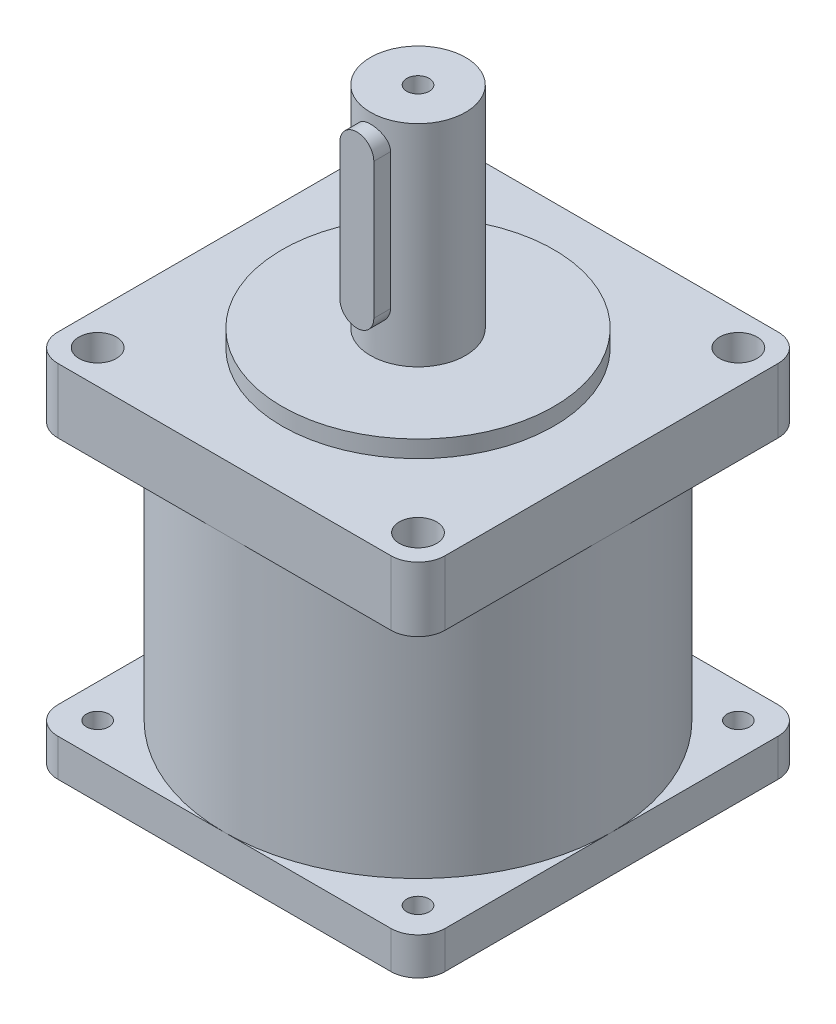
from build123d import *

# Parameters (mm, degrees)
SKETCH_1_W             = 57
SKETCH_1_H             = 57
EXTRUDE_1_DEPTH        = 9.5
SKETCH_2_R             = 20
EXTRUDE_2_DEPTH        = 2.5
SKETCH_3_R             = 7
EXTRUDE_3_DEPTH        = 33.5
SKETCH_5_R             = 2.75
CUT_EXTRUDE_1_DEPTH    = 9.5
HOLE_WIZARD_M4_1_D     = 3.3
HOLE_WIZARD_M4_1_DEPTH = 11.5
HOLE_WIZARD_M4_1_TIP   = 0.991420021
EXTRUDE_4_DEPTH        = 5
SKETCH_9_R             = 28.5
EXTRUDE_5_DEPTH        = 38
SKETCH_10_W            = 57
SKETCH_10_H            = 57
EXTRUDE_6_DEPTH        = 5.5
HOLE_WIZARD_M4_2_D     = 3.3
HOLE_WIZARD_M4_2_DEPTH = 9
HOLE_WIZARD_M4_2_TIP   = 0.991420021
FILLET_1_R             = 4
SKETCH_13_R            = 19.05
CUT_EXTRUDE_2_DEPTH    = 2.5
SKETCH_14_R            = 4
CUT_EXTRUDE_3_DEPTH    = 7


with BuildPart() as part:
    # Sketch 1 → Extrude 1 (new body)
    with BuildSketch(Plane(origin=(0, 0, 0), x_dir=(1, 0, 0), z_dir=(0, 1, 0))):
        Rectangle(SKETCH_1_W, SKETCH_1_H)
    extrude(amount=EXTRUDE_1_DEPTH)

    # Sketch 2 → Extrude 2 (add)
    with BuildSketch(Plane(origin=(0, 9.5, 0), x_dir=(1, 0, 0), z_dir=(0, 1, 0))):
        with Locations(Location((0, 0, 0), (0, 0, 270))):
            Circle(SKETCH_2_R)
    extrude(amount=EXTRUDE_2_DEPTH)

    # Sketch 3 → Extrude 3 (add)
    with BuildSketch(Plane(origin=(0, 9.5, 0), x_dir=(1, 0, 0), z_dir=(0, 1, 0))):
        with Locations(Location((0, 0, 0), (0, 0, 270))):
            Circle(SKETCH_3_R)
    extrude(amount=EXTRUDE_3_DEPTH)

    # Sketch 5 → Cut-Extrude 1 (cut)
    with BuildSketch(Plane(origin=(0, 9.5, 0), x_dir=(1, 0, 0), z_dir=(0, 1, 0))):
        with Locations(Location((-23.57, 23.57, 0), (0, 0, 270))):
            Circle(SKETCH_5_R)
        with Locations(Location((-23.57, -23.57, 0), (0, 0, 270))):
            Circle(SKETCH_5_R)
        with Locations(Location((23.57, -23.57, 0), (0, 0, 270))):
            Circle(SKETCH_5_R)
        with Locations(Location((23.57, 23.57, 0), (0, 0, 270))):
            Circle(SKETCH_5_R)
    extrude(amount=-CUT_EXTRUDE_1_DEPTH, mode=Mode.SUBTRACT)

    # Hole Wizard M4 _1
    with Locations(Plane(origin=(0, 43, 0), x_dir=(1, 0, 0), z_dir=(0, 1, 0))):
        with Locations((0, 0)):
            Hole(HOLE_WIZARD_M4_1_D / 2, depth=HOLE_WIZARD_M4_1_DEPTH)
            with Locations((0, 0, -(HOLE_WIZARD_M4_1_DEPTH + HOLE_WIZARD_M4_1_TIP / 2))):  # 118° drill point
                Cone(0, HOLE_WIZARD_M4_1_D / 2, HOLE_WIZARD_M4_1_TIP, mode=Mode.SUBTRACT)

    # Sketch 8 → Extrude 4 (add)
    with BuildSketch(Plane.XY.offset(4)):
        with BuildLine():
            Line((-2.5, 39), (-2.5, 19))
            ThreePointArc((-2.5, 19), (0, 16.5), (2.5, 19))
            Line((2.5, 19), (2.5, 39))
            ThreePointArc((2.5, 39), (0, 41.5), (-2.5, 39))
        make_face()
    extrude(amount=EXTRUDE_4_DEPTH)

    # Sketch 9 → Extrude 5 (add)
    with BuildSketch(Plane(origin=(0, 0, 0), x_dir=(1, 0, 0), z_dir=(0, 1, 0))):
        with Locations(Location((0, 0, 0), (0, 0, 270))):
            Circle(SKETCH_9_R)
    extrude(amount=-EXTRUDE_5_DEPTH)

    # Sketch 10 → Extrude 6 (add)
    with BuildSketch(Plane(origin=(0, -38, 0), x_dir=(-1, 0, 0), z_dir=(0, -1, 0))):
        Rectangle(SKETCH_10_W, SKETCH_10_H)
    extrude(amount=EXTRUDE_6_DEPTH)

    # Hole Wizard M4 _2
    with Locations(Plane(origin=(0, -38, 0), x_dir=(-1, 0, 0), z_dir=(0, 1, 0))):
        with Locations((23.57, 23.57), (23.57, -23.57), (-23.57, -23.57), (-23.57, 23.57)):
            Hole(HOLE_WIZARD_M4_2_D / 2, depth=HOLE_WIZARD_M4_2_DEPTH)
            with Locations((0, 0, -(HOLE_WIZARD_M4_2_DEPTH + HOLE_WIZARD_M4_2_TIP / 2))):  # 118° drill point
                Cone(0, HOLE_WIZARD_M4_2_D / 2, HOLE_WIZARD_M4_2_TIP, mode=Mode.SUBTRACT)

    # Fillet 1
    fillet_1_edges = [part.edges().sort_by_distance(p)[0] for p in [
        (28.5, -40.75, -28.5),
        (28.5, -40.75, 28.5),
        (-28.5, -40.75, 28.5),
        (-28.5, -40.75, -28.5),
        (28.5, 4.75, 28.5),
        (-28.5, 4.75, 28.5),
        (-28.5, 4.75, -28.5),
        (28.5, 4.75, -28.5),
    ]]
    fillet(fillet_1_edges, radius=FILLET_1_R)

    # Sketch 13 → Cut-Extrude 2 (cut)
    with BuildSketch(Plane(origin=(0, -43.5, 0), x_dir=(-1, 0, 0), z_dir=(0, -1, 0))):
        with Locations(Location((0, 0, 0), (0, 0, 90))):
            Circle(SKETCH_13_R)
    extrude(amount=-CUT_EXTRUDE_2_DEPTH, mode=Mode.SUBTRACT)

    # Sketch 14 → Cut-Extrude 3 (cut)
    with BuildSketch(Plane(origin=(0, -43.5, 0), x_dir=(-1, 0, 0), z_dir=(0, -1, 0))):
        with Locations(Location((0, 0, 0), (0, 0, 90))):
            Circle(SKETCH_14_R)
    extrude(amount=-CUT_EXTRUDE_3_DEPTH, mode=Mode.SUBTRACT)


solid = part.part
